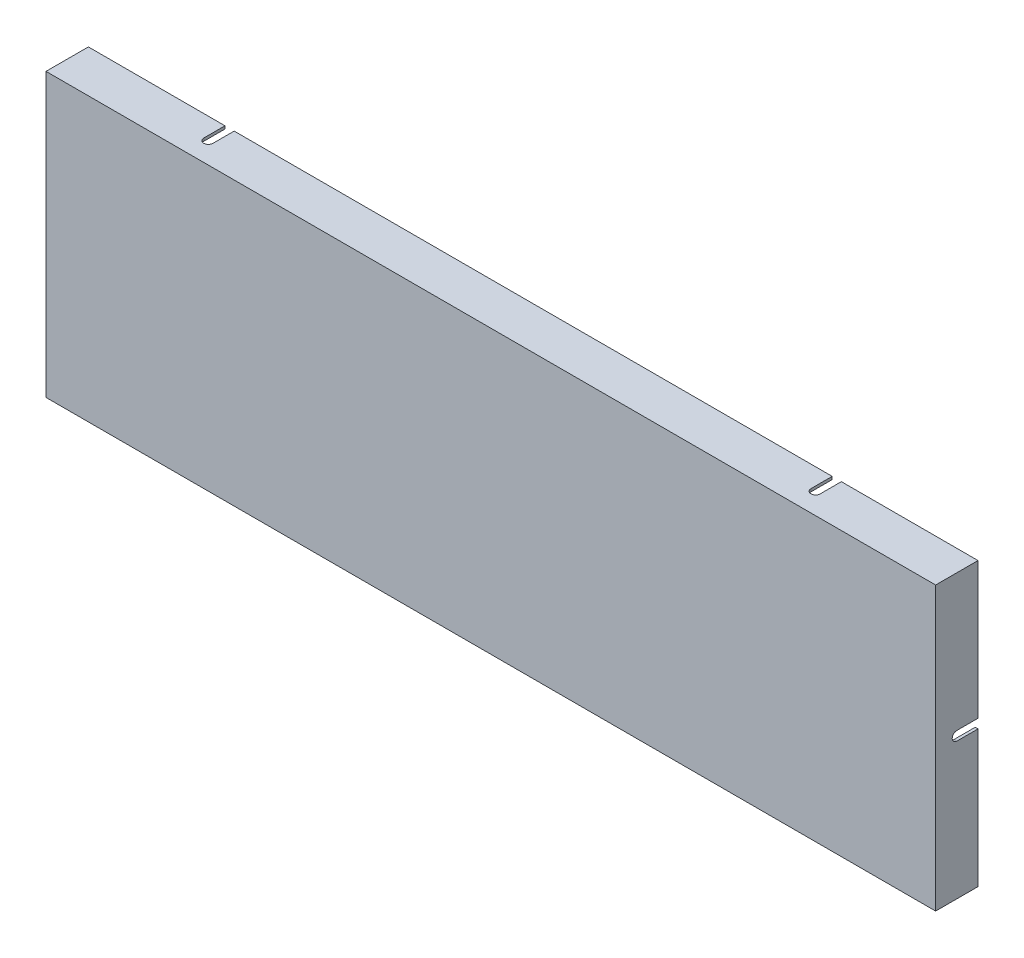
ISO-10303-21;
HEADER;
FILE_DESCRIPTION(('STEP AP214'),'2;1');
FILE_NAME('part.step','',(''),(''),'','','');
FILE_SCHEMA(('AUTOMOTIVE_DESIGN { 1 0 10303 214 1 1 1 1 }'));
ENDSEC;
DATA;
#1=APPLICATION_CONTEXT('core data for automotive mechanical design processes');
#2=APPLICATION_PROTOCOL_DEFINITION('international standard','automotive_design',2000,#1);
#3=PRODUCT_CONTEXT('',#1,'mechanical');
#4=PRODUCT('Part','Part','',(#3));
#5=PRODUCT_RELATED_PRODUCT_CATEGORY('part','',(#4));
#6=PRODUCT_DEFINITION_FORMATION('','',#4);
#7=PRODUCT_DEFINITION_CONTEXT('part definition',#1,'design');
#8=PRODUCT_DEFINITION('design','',#6,#7);
#9=PRODUCT_DEFINITION_SHAPE('','',#8);
#10=(LENGTH_UNIT() NAMED_UNIT(*) SI_UNIT(.MILLI.,.METRE.));
#11=(NAMED_UNIT(*) PLANE_ANGLE_UNIT() SI_UNIT($,.RADIAN.));
#12=(NAMED_UNIT(*) SI_UNIT($,.STERADIAN.) SOLID_ANGLE_UNIT());
#13=UNCERTAINTY_MEASURE_WITH_UNIT(LENGTH_MEASURE(1.E-05),#10,'distance_accuracy_value','');
#14=(GEOMETRIC_REPRESENTATION_CONTEXT(3) GLOBAL_UNCERTAINTY_ASSIGNED_CONTEXT((#13)) GLOBAL_UNIT_ASSIGNED_CONTEXT((#10,
#11,#12)) REPRESENTATION_CONTEXT('',''));
#15=CARTESIAN_POINT('',(0.,0.,0.));
#16=DIRECTION('',(0.,0.,1.));
#17=DIRECTION('',(1.,0.,0.));
#18=AXIS2_PLACEMENT_3D('',#15,#16,#17);
#19=CARTESIAN_POINT('',(0.,-200.,0.));
#20=DIRECTION('',(0.,0.,1.));
#21=DIRECTION('',(1.,0.,0.));
#22=AXIS2_PLACEMENT_3D('',#19,#20,#21);
#23=PLANE('',#22);
#24=DIRECTION('',(0.,1.,0.));
#25=VECTOR('',#24,1.);
#26=CARTESIAN_POINT('',(630.,0.,0.));
#27=LINE('',#26,#25);
#28=CARTESIAN_POINT('',(630.,-96.7499999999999,0.));
#29=VERTEX_POINT('',#28);
#30=CARTESIAN_POINT('',(630.,0.,0.));
#31=VERTEX_POINT('',#30);
#32=EDGE_CURVE('E268',#29,#31,#27,.T.);
#33=ORIENTED_EDGE('',*,*,#32,.F.);
#34=DIRECTION('',(-1.,0.,0.));
#35=VECTOR('',#34,1.);
#36=CARTESIAN_POINT('',(630.,-96.7499999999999,0.));
#37=LINE('',#36,#35);
#38=CARTESIAN_POINT('',(628.,-96.7499999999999,0.));
#39=VERTEX_POINT('',#38);
#40=EDGE_CURVE('E477',#29,#39,#37,.T.);
#41=ORIENTED_EDGE('',*,*,#40,.T.);
#42=DIRECTION('',(0.,1.,0.));
#43=VECTOR('',#42,1.);
#44=CARTESIAN_POINT('',(628.,0.,0.));
#45=LINE('',#44,#43);
#46=CARTESIAN_POINT('',(628.,-2.,0.));
#47=VERTEX_POINT('',#46);
#48=EDGE_CURVE('E324',#39,#47,#45,.T.);
#49=ORIENTED_EDGE('',*,*,#48,.T.);
#50=DIRECTION('',(-1.,0.,0.));
#51=VECTOR('',#50,1.);
#52=CARTESIAN_POINT('',(0.,-2.,0.));
#53=LINE('',#52,#51);
#54=CARTESIAN_POINT('',(533.25,-2.,0.));
#55=VERTEX_POINT('',#54);
#56=EDGE_CURVE('E338',#47,#55,#53,.T.);
#57=ORIENTED_EDGE('',*,*,#56,.T.);
#58=DIRECTION('',(0.,1.,0.));
#59=VECTOR('',#58,1.);
#60=CARTESIAN_POINT('',(533.25,-200.,0.));
#61=LINE('',#60,#59);
#62=CARTESIAN_POINT('',(533.25,0.,0.));
#63=VERTEX_POINT('',#62);
#64=EDGE_CURVE('E452',#55,#63,#61,.T.);
#65=ORIENTED_EDGE('',*,*,#64,.T.);
#66=DIRECTION('',(-1.,0.,0.));
#67=VECTOR('',#66,1.);
#68=CARTESIAN_POINT('',(0.,0.,0.));
#69=LINE('',#68,#67);
#70=EDGE_CURVE('E272',#31,#63,#69,.T.);
#71=ORIENTED_EDGE('',*,*,#70,.F.);
#72=EDGE_LOOP('',(#33,#41,#49,#57,#65,#71));
#73=FACE_BOUND('',#72,.T.);
#74=ADVANCED_FACE('F35',(#73),#23,.F.);
#75=DIRECTION('',(0.,-1.,0.));
#76=VECTOR('',#75,1.);
#77=CARTESIAN_POINT('',(2.,0.,0.));
#78=LINE('',#77,#76);
#79=CARTESIAN_POINT('',(2.,-2.,0.));
#80=VERTEX_POINT('',#79);
#81=CARTESIAN_POINT('',(2.,-96.75,0.));
#82=VERTEX_POINT('',#81);
#83=EDGE_CURVE('E384',#80,#82,#78,.T.);
#84=ORIENTED_EDGE('',*,*,#83,.T.);
#85=CARTESIAN_POINT('',(0.,-96.75,0.));
#86=VERTEX_POINT('',#85);
#87=EDGE_CURVE('E318',#82,#86,#37,.T.);
#88=ORIENTED_EDGE('',*,*,#87,.T.);
#89=DIRECTION('',(0.,-1.,0.));
#90=VECTOR('',#89,1.);
#91=CARTESIAN_POINT('',(0.,0.,0.));
#92=LINE('',#91,#90);
#93=CARTESIAN_POINT('',(0.,0.,0.));
#94=VERTEX_POINT('',#93);
#95=EDGE_CURVE('E347',#94,#86,#92,.T.);
#96=ORIENTED_EDGE('',*,*,#95,.F.);
#97=CARTESIAN_POINT('',(96.75,0.,0.));
#98=VERTEX_POINT('',#97);
#99=EDGE_CURVE('E267',#98,#94,#69,.T.);
#100=ORIENTED_EDGE('',*,*,#99,.F.);
#101=DIRECTION('',(0.,1.,0.));
#102=VECTOR('',#101,1.);
#103=CARTESIAN_POINT('',(96.75,-200.,0.));
#104=LINE('',#103,#102);
#105=CARTESIAN_POINT('',(96.75,-2.,0.));
#106=VERTEX_POINT('',#105);
#107=EDGE_CURVE('E408',#106,#98,#104,.T.);
#108=ORIENTED_EDGE('',*,*,#107,.F.);
#109=EDGE_CURVE('E332',#106,#80,#53,.T.);
#110=ORIENTED_EDGE('',*,*,#109,.T.);
#111=EDGE_LOOP('',(#84,#88,#96,#100,#108,#110));
#112=FACE_BOUND('',#111,.T.);
#113=ADVANCED_FACE('F531',(#112),#23,.F.);
#114=CARTESIAN_POINT('',(628.,-198.,0.));
#115=VERTEX_POINT('',#114);
#116=CARTESIAN_POINT('',(628.,-103.25,0.));
#117=VERTEX_POINT('',#116);
#118=EDGE_CURVE('E259',#115,#117,#45,.T.);
#119=ORIENTED_EDGE('',*,*,#118,.T.);
#120=DIRECTION('',(-1.,0.,0.));
#121=VECTOR('',#120,1.);
#122=CARTESIAN_POINT('',(630.,-103.25,0.));
#123=LINE('',#122,#121);
#124=CARTESIAN_POINT('',(630.,-103.25,0.));
#125=VERTEX_POINT('',#124);
#126=EDGE_CURVE('E58',#125,#117,#123,.T.);
#127=ORIENTED_EDGE('',*,*,#126,.F.);
#128=CARTESIAN_POINT('',(630.,-200.,0.));
#129=VERTEX_POINT('',#128);
#130=EDGE_CURVE('E257',#129,#125,#27,.T.);
#131=ORIENTED_EDGE('',*,*,#130,.F.);
#132=DIRECTION('',(1.,0.,0.));
#133=VECTOR('',#132,1.);
#134=CARTESIAN_POINT('',(0.,-200.,0.));
#135=LINE('',#134,#133);
#136=CARTESIAN_POINT('',(533.25,-200.,0.));
#137=VERTEX_POINT('',#136);
#138=EDGE_CURVE('E349',#137,#129,#135,.T.);
#139=ORIENTED_EDGE('',*,*,#138,.F.);
#140=CARTESIAN_POINT('',(533.25,-198.,0.));
#141=VERTEX_POINT('',#140);
#142=EDGE_CURVE('E440',#137,#141,#61,.T.);
#143=ORIENTED_EDGE('',*,*,#142,.T.);
#144=DIRECTION('',(1.,0.,0.));
#145=VECTOR('',#144,1.);
#146=CARTESIAN_POINT('',(0.,-198.,0.));
#147=LINE('',#146,#145);
#148=EDGE_CURVE('E336',#141,#115,#147,.T.);
#149=ORIENTED_EDGE('',*,*,#148,.T.);
#150=EDGE_LOOP('',(#119,#127,#131,#139,#143,#149));
#151=FACE_BOUND('',#150,.T.);
#152=ADVANCED_FACE('F255',(#151),#23,.F.);
#153=CARTESIAN_POINT('',(526.75,0.,0.));
#154=VERTEX_POINT('',#153);
#155=CARTESIAN_POINT('',(103.25,0.,0.));
#156=VERTEX_POINT('',#155);
#157=EDGE_CURVE('E270',#154,#156,#69,.T.);
#158=ORIENTED_EDGE('',*,*,#157,.F.);
#159=DIRECTION('',(0.,1.,0.));
#160=VECTOR('',#159,1.);
#161=CARTESIAN_POINT('',(526.75,-200.,0.));
#162=LINE('',#161,#160);
#163=CARTESIAN_POINT('',(526.75,-2.,0.));
#164=VERTEX_POINT('',#163);
#165=EDGE_CURVE('E444',#164,#154,#162,.T.);
#166=ORIENTED_EDGE('',*,*,#165,.F.);
#167=CARTESIAN_POINT('',(103.25,-2.,0.));
#168=VERTEX_POINT('',#167);
#169=EDGE_CURVE('E605',#164,#168,#53,.T.);
#170=ORIENTED_EDGE('',*,*,#169,.T.);
#171=DIRECTION('',(0.,1.,0.));
#172=VECTOR('',#171,1.);
#173=CARTESIAN_POINT('',(103.25,-200.,0.));
#174=LINE('',#173,#172);
#175=EDGE_CURVE('E414',#168,#156,#174,.T.);
#176=ORIENTED_EDGE('',*,*,#175,.T.);
#177=EDGE_LOOP('',(#158,#166,#170,#176));
#178=FACE_BOUND('',#177,.T.);
#179=ADVANCED_FACE('F579',(#178),#23,.F.);
#180=CARTESIAN_POINT('',(103.25,-198.,0.));
#181=VERTEX_POINT('',#180);
#182=CARTESIAN_POINT('',(526.75,-198.,0.));
#183=VERTEX_POINT('',#182);
#184=EDGE_CURVE('E334',#181,#183,#147,.T.);
#185=ORIENTED_EDGE('',*,*,#184,.T.);
#186=CARTESIAN_POINT('',(526.75,-200.,0.));
#187=VERTEX_POINT('',#186);
#188=EDGE_CURVE('E441',#187,#183,#162,.T.);
#189=ORIENTED_EDGE('',*,*,#188,.F.);
#190=CARTESIAN_POINT('',(103.25,-200.,0.));
#191=VERTEX_POINT('',#190);
#192=EDGE_CURVE('E354',#191,#187,#135,.T.);
#193=ORIENTED_EDGE('',*,*,#192,.F.);
#194=EDGE_CURVE('E402',#191,#181,#174,.T.);
#195=ORIENTED_EDGE('',*,*,#194,.T.);
#196=EDGE_LOOP('',(#185,#189,#193,#195));
#197=FACE_BOUND('',#196,.T.);
#198=ADVANCED_FACE('F544',(#197),#23,.F.);
#199=CARTESIAN_POINT('',(0.,0.,30.));
#200=DIRECTION('',(1.,0.,0.));
#201=DIRECTION('',(0.,1.,0.));
#202=AXIS2_PLACEMENT_3D('',#199,#200,#201);
#203=PLANE('',#202);
#204=ORIENTED_EDGE('',*,*,#95,.T.);
#205=DIRECTION('',(0.,0.,-1.));
#206=VECTOR('',#205,1.);
#207=CARTESIAN_POINT('',(0.,-96.75,0.));
#208=LINE('',#207,#206);
#209=CARTESIAN_POINT('',(0.,-96.75,15.));
#210=VERTEX_POINT('',#209);
#211=EDGE_CURVE('E250',#210,#86,#208,.T.);
#212=ORIENTED_EDGE('',*,*,#211,.F.);
#213=CARTESIAN_POINT('',(0.,-100.,15.));
#214=DIRECTION('',(-1.,0.,0.));
#215=DIRECTION('',(0.,-1.,0.));
#216=AXIS2_PLACEMENT_3D('',#213,#214,#215);
#217=CIRCLE('',#216,3.25);
#218=CARTESIAN_POINT('',(0.,-103.25,15.));
#219=VERTEX_POINT('',#218);
#220=EDGE_CURVE('E482',#219,#210,#217,.T.);
#221=ORIENTED_EDGE('',*,*,#220,.F.);
#222=DIRECTION('',(0.,0.,1.));
#223=VECTOR('',#222,1.);
#224=CARTESIAN_POINT('',(0.,-103.25,0.));
#225=LINE('',#224,#223);
#226=CARTESIAN_POINT('',(0.,-103.25,0.));
#227=VERTEX_POINT('',#226);
#228=EDGE_CURVE('E485',#227,#219,#225,.T.);
#229=ORIENTED_EDGE('',*,*,#228,.F.);
#230=CARTESIAN_POINT('',(0.,-200.,0.));
#231=VERTEX_POINT('',#230);
#232=EDGE_CURVE('E350',#227,#231,#92,.T.);
#233=ORIENTED_EDGE('',*,*,#232,.T.);
#234=DIRECTION('',(0.,0.,-1.));
#235=VECTOR('',#234,1.);
#236=CARTESIAN_POINT('',(0.,-200.,30.));
#237=LINE('',#236,#235);
#238=CARTESIAN_POINT('',(0.,-200.,30.));
#239=VERTEX_POINT('',#238);
#240=EDGE_CURVE('E287',#239,#231,#237,.T.);
#241=ORIENTED_EDGE('',*,*,#240,.F.);
#242=DIRECTION('',(0.,-1.,0.));
#243=VECTOR('',#242,1.);
#244=CARTESIAN_POINT('',(0.,0.,30.));
#245=LINE('',#244,#243);
#246=CARTESIAN_POINT('',(0.,0.,30.));
#247=VERTEX_POINT('',#246);
#248=EDGE_CURVE('E278',#247,#239,#245,.T.);
#249=ORIENTED_EDGE('',*,*,#248,.F.);
#250=DIRECTION('',(0.,0.,-1.));
#251=VECTOR('',#250,1.);
#252=CARTESIAN_POINT('',(0.,0.,30.));
#253=LINE('',#252,#251);
#254=EDGE_CURVE('E279',#247,#94,#253,.T.);
#255=ORIENTED_EDGE('',*,*,#254,.T.);
#256=EDGE_LOOP('',(#204,#212,#221,#229,#233,#241,#249,#255));
#257=FACE_BOUND('',#256,.T.);
#258=ADVANCED_FACE('F37',(#257),#203,.F.);
#259=CARTESIAN_POINT('',(0.,-200.,30.));
#260=DIRECTION('',(0.,1.,0.));
#261=DIRECTION('',(0.,0.,1.));
#262=AXIS2_PLACEMENT_3D('',#259,#260,#261);
#263=PLANE('',#262);
#264=CARTESIAN_POINT('',(530.,-200.,15.));
#265=DIRECTION('',(0.,1.,0.));
#266=DIRECTION('',(0.,0.,1.));
#267=AXIS2_PLACEMENT_3D('',#264,#265,#266);
#268=CIRCLE('',#267,3.25000000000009);
#269=CARTESIAN_POINT('',(526.75,-200.,15.));
#270=VERTEX_POINT('',#269);
#271=CARTESIAN_POINT('',(533.25,-200.,15.));
#272=VERTEX_POINT('',#271);
#273=EDGE_CURVE('E468',#270,#272,#268,.T.);
#274=ORIENTED_EDGE('',*,*,#273,.T.);
#275=DIRECTION('',(0.,0.,-1.));
#276=VECTOR('',#275,1.);
#277=CARTESIAN_POINT('',(533.25,-200.,0.));
#278=LINE('',#277,#276);
#279=EDGE_CURVE('E465',#272,#137,#278,.T.);
#280=ORIENTED_EDGE('',*,*,#279,.T.);
#281=ORIENTED_EDGE('',*,*,#138,.T.);
#282=DIRECTION('',(0.,0.,-1.));
#283=VECTOR('',#282,1.);
#284=CARTESIAN_POINT('',(630.,-200.,30.));
#285=LINE('',#284,#283);
#286=CARTESIAN_POINT('',(630.,-200.,30.));
#287=VERTEX_POINT('',#286);
#288=EDGE_CURVE('E266',#287,#129,#285,.T.);
#289=ORIENTED_EDGE('',*,*,#288,.F.);
#290=DIRECTION('',(1.,0.,0.));
#291=VECTOR('',#290,1.);
#292=CARTESIAN_POINT('',(0.,-200.,30.));
#293=LINE('',#292,#291);
#294=EDGE_CURVE('E343',#239,#287,#293,.T.);
#295=ORIENTED_EDGE('',*,*,#294,.F.);
#296=ORIENTED_EDGE('',*,*,#240,.T.);
#297=CARTESIAN_POINT('',(96.75,-200.,0.));
#298=VERTEX_POINT('',#297);
#299=EDGE_CURVE('E273',#231,#298,#135,.T.);
#300=ORIENTED_EDGE('',*,*,#299,.T.);
#301=DIRECTION('',(0.,0.,1.));
#302=VECTOR('',#301,1.);
#303=CARTESIAN_POINT('',(96.75,-200.,0.));
#304=LINE('',#303,#302);
#305=CARTESIAN_POINT('',(96.75,-200.,15.));
#306=VERTEX_POINT('',#305);
#307=EDGE_CURVE('E419',#298,#306,#304,.T.);
#308=ORIENTED_EDGE('',*,*,#307,.T.);
#309=CARTESIAN_POINT('',(100.,-200.,15.));
#310=DIRECTION('',(0.,1.,0.));
#311=DIRECTION('',(0.,0.,1.));
#312=AXIS2_PLACEMENT_3D('',#309,#310,#311);
#313=CIRCLE('',#312,3.24999999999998);
#314=CARTESIAN_POINT('',(103.25,-200.,15.));
#315=VERTEX_POINT('',#314);
#316=EDGE_CURVE('E430',#306,#315,#313,.T.);
#317=ORIENTED_EDGE('',*,*,#316,.T.);
#318=DIRECTION('',(0.,0.,-1.));
#319=VECTOR('',#318,1.);
#320=CARTESIAN_POINT('',(103.25,-200.,0.));
#321=LINE('',#320,#319);
#322=EDGE_CURVE('E427',#315,#191,#321,.T.);
#323=ORIENTED_EDGE('',*,*,#322,.T.);
#324=ORIENTED_EDGE('',*,*,#192,.T.);
#325=DIRECTION('',(0.,0.,1.));
#326=VECTOR('',#325,1.);
#327=CARTESIAN_POINT('',(526.75,-200.,0.));
#328=LINE('',#327,#326);
#329=EDGE_CURVE('E457',#187,#270,#328,.T.);
#330=ORIENTED_EDGE('',*,*,#329,.T.);
#331=EDGE_LOOP('',(#274,#280,#281,#289,#295,#296,#300,#308,#317,#323,#324,#330));
#332=FACE_BOUND('',#331,.T.);
#333=ADVANCED_FACE('F502',(#332),#263,.F.);
#334=CARTESIAN_POINT('',(630.,0.,30.));
#335=DIRECTION('',(-1.,0.,0.));
#336=DIRECTION('',(0.,0.,1.));
#337=AXIS2_PLACEMENT_3D('',#334,#335,#336);
#338=PLANE('',#337);
#339=CARTESIAN_POINT('',(630.,-99.9999999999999,15.));
#340=DIRECTION('',(-1.,0.,0.));
#341=DIRECTION('',(0.,-1.,0.));
#342=AXIS2_PLACEMENT_3D('',#339,#340,#341);
#343=CIRCLE('',#342,3.25);
#344=CARTESIAN_POINT('',(630.,-103.25,15.));
#345=VERTEX_POINT('',#344);
#346=CARTESIAN_POINT('',(630.,-96.7499999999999,15.));
#347=VERTEX_POINT('',#346);
#348=EDGE_CURVE('E249',#345,#347,#343,.T.);
#349=ORIENTED_EDGE('',*,*,#348,.T.);
#350=DIRECTION('',(0.,0.,-1.));
#351=VECTOR('',#350,1.);
#352=CARTESIAN_POINT('',(630.,-96.7499999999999,0.));
#353=LINE('',#352,#351);
#354=EDGE_CURVE('E317',#347,#29,#353,.T.);
#355=ORIENTED_EDGE('',*,*,#354,.T.);
#356=ORIENTED_EDGE('',*,*,#32,.T.);
#357=DIRECTION('',(0.,0.,-1.));
#358=VECTOR('',#357,1.);
#359=CARTESIAN_POINT('',(630.,0.,30.));
#360=LINE('',#359,#358);
#361=CARTESIAN_POINT('',(630.,0.,30.));
#362=VERTEX_POINT('',#361);
#363=EDGE_CURVE('E282',#362,#31,#360,.T.);
#364=ORIENTED_EDGE('',*,*,#363,.F.);
#365=DIRECTION('',(0.,1.,0.));
#366=VECTOR('',#365,1.);
#367=CARTESIAN_POINT('',(630.,0.,30.));
#368=LINE('',#367,#366);
#369=EDGE_CURVE('E345',#287,#362,#368,.T.);
#370=ORIENTED_EDGE('',*,*,#369,.F.);
#371=ORIENTED_EDGE('',*,*,#288,.T.);
#372=ORIENTED_EDGE('',*,*,#130,.T.);
#373=DIRECTION('',(0.,0.,1.));
#374=VECTOR('',#373,1.);
#375=CARTESIAN_POINT('',(630.,-103.25,0.));
#376=LINE('',#375,#374);
#377=EDGE_CURVE('E241',#125,#345,#376,.T.);
#378=ORIENTED_EDGE('',*,*,#377,.T.);
#379=EDGE_LOOP('',(#349,#355,#356,#364,#370,#371,#372,#378));
#380=FACE_BOUND('',#379,.T.);
#381=ADVANCED_FACE('F263',(#380),#338,.F.);
#382=CARTESIAN_POINT('',(0.,0.,30.));
#383=DIRECTION('',(0.,-1.,0.));
#384=DIRECTION('',(0.,0.,-1.));
#385=AXIS2_PLACEMENT_3D('',#382,#383,#384);
#386=PLANE('',#385);
#387=ORIENTED_EDGE('',*,*,#70,.T.);
#388=DIRECTION('',(0.,0.,-1.));
#389=VECTOR('',#388,1.);
#390=CARTESIAN_POINT('',(533.25,0.,0.));
#391=LINE('',#390,#389);
#392=CARTESIAN_POINT('',(533.25,0.,15.));
#393=VERTEX_POINT('',#392);
#394=EDGE_CURVE('E455',#393,#63,#391,.T.);
#395=ORIENTED_EDGE('',*,*,#394,.F.);
#396=CARTESIAN_POINT('',(530.,0.,15.));
#397=DIRECTION('',(0.,1.,0.));
#398=DIRECTION('',(0.,0.,1.));
#399=AXIS2_PLACEMENT_3D('',#396,#397,#398);
#400=CIRCLE('',#399,3.25000000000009);
#401=CARTESIAN_POINT('',(526.75,0.,15.));
#402=VERTEX_POINT('',#401);
#403=EDGE_CURVE('E458',#402,#393,#400,.T.);
#404=ORIENTED_EDGE('',*,*,#403,.F.);
#405=DIRECTION('',(0.,0.,1.));
#406=VECTOR('',#405,1.);
#407=CARTESIAN_POINT('',(526.75,0.,0.));
#408=LINE('',#407,#406);
#409=EDGE_CURVE('E461',#154,#402,#408,.T.);
#410=ORIENTED_EDGE('',*,*,#409,.F.);
#411=ORIENTED_EDGE('',*,*,#157,.T.);
#412=DIRECTION('',(0.,0.,-1.));
#413=VECTOR('',#412,1.);
#414=CARTESIAN_POINT('',(103.25,0.,0.));
#415=LINE('',#414,#413);
#416=CARTESIAN_POINT('',(103.25,0.,15.));
#417=VERTEX_POINT('',#416);
#418=EDGE_CURVE('E416',#417,#156,#415,.T.);
#419=ORIENTED_EDGE('',*,*,#418,.F.);
#420=CARTESIAN_POINT('',(100.,0.,15.));
#421=DIRECTION('',(0.,1.,0.));
#422=DIRECTION('',(0.,0.,1.));
#423=AXIS2_PLACEMENT_3D('',#420,#421,#422);
#424=CIRCLE('',#423,3.24999999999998);
#425=CARTESIAN_POINT('',(96.75,0.,15.));
#426=VERTEX_POINT('',#425);
#427=EDGE_CURVE('E420',#426,#417,#424,.T.);
#428=ORIENTED_EDGE('',*,*,#427,.F.);
#429=DIRECTION('',(0.,0.,1.));
#430=VECTOR('',#429,1.);
#431=CARTESIAN_POINT('',(96.75,0.,0.));
#432=LINE('',#431,#430);
#433=EDGE_CURVE('E423',#98,#426,#432,.T.);
#434=ORIENTED_EDGE('',*,*,#433,.F.);
#435=ORIENTED_EDGE('',*,*,#99,.T.);
#436=ORIENTED_EDGE('',*,*,#254,.F.);
#437=DIRECTION('',(-1.,0.,0.));
#438=VECTOR('',#437,1.);
#439=CARTESIAN_POINT('',(0.,0.,30.));
#440=LINE('',#439,#438);
#441=EDGE_CURVE('E283',#362,#247,#440,.T.);
#442=ORIENTED_EDGE('',*,*,#441,.F.);
#443=ORIENTED_EDGE('',*,*,#363,.T.);
#444=EDGE_LOOP('',(#387,#395,#404,#410,#411,#419,#428,#434,#435,#436,#442,#443));
#445=FACE_BOUND('',#444,.T.);
#446=ADVANCED_FACE('F494',(#445),#386,.F.);
#447=CARTESIAN_POINT('',(0.,-200.,30.));
#448=DIRECTION('',(0.,0.,1.));
#449=DIRECTION('',(1.,0.,0.));
#450=AXIS2_PLACEMENT_3D('',#447,#448,#449);
#451=PLANE('',#450);
#452=ORIENTED_EDGE('',*,*,#248,.T.);
#453=ORIENTED_EDGE('',*,*,#294,.T.);
#454=ORIENTED_EDGE('',*,*,#369,.T.);
#455=ORIENTED_EDGE('',*,*,#441,.T.);
#456=EDGE_LOOP('',(#452,#453,#454,#455));
#457=FACE_BOUND('',#456,.T.);
#458=ADVANCED_FACE('F499',(#457),#451,.T.);
#459=ORIENTED_EDGE('',*,*,#232,.F.);
#460=CARTESIAN_POINT('',(2.,-103.25,0.));
#461=VERTEX_POINT('',#460);
#462=EDGE_CURVE('E260',#461,#227,#123,.T.);
#463=ORIENTED_EDGE('',*,*,#462,.F.);
#464=CARTESIAN_POINT('',(2.00000000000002,-198.,0.));
#465=VERTEX_POINT('',#464);
#466=EDGE_CURVE('E386',#461,#465,#78,.T.);
#467=ORIENTED_EDGE('',*,*,#466,.T.);
#468=CARTESIAN_POINT('',(96.75,-198.,0.));
#469=VERTEX_POINT('',#468);
#470=EDGE_CURVE('E330',#465,#469,#147,.T.);
#471=ORIENTED_EDGE('',*,*,#470,.T.);
#472=EDGE_CURVE('E405',#298,#469,#104,.T.);
#473=ORIENTED_EDGE('',*,*,#472,.F.);
#474=ORIENTED_EDGE('',*,*,#299,.F.);
#475=EDGE_LOOP('',(#459,#463,#467,#471,#473,#474));
#476=FACE_BOUND('',#475,.T.);
#477=ADVANCED_FACE('F566',(#476),#23,.F.);
#478=CARTESIAN_POINT('',(2.,0.,30.));
#479=DIRECTION('',(1.,0.,0.));
#480=DIRECTION('',(0.,1.,0.));
#481=AXIS2_PLACEMENT_3D('',#478,#479,#480);
#482=PLANE('',#481);
#483=DIRECTION('',(0.,0.,1.));
#484=VECTOR('',#483,1.);
#485=CARTESIAN_POINT('',(2.00000000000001,-96.75,30.));
#486=LINE('',#485,#484);
#487=CARTESIAN_POINT('',(2.,-96.75,15.));
#488=VERTEX_POINT('',#487);
#489=EDGE_CURVE('E464',#82,#488,#486,.T.);
#490=ORIENTED_EDGE('',*,*,#489,.F.);
#491=ORIENTED_EDGE('',*,*,#83,.F.);
#492=DIRECTION('',(0.,0.,-1.));
#493=VECTOR('',#492,1.);
#494=CARTESIAN_POINT('',(2.,-2.,30.));
#495=LINE('',#494,#493);
#496=CARTESIAN_POINT('',(2.,-2.,28.));
#497=VERTEX_POINT('',#496);
#498=EDGE_CURVE('E376',#497,#80,#495,.T.);
#499=ORIENTED_EDGE('',*,*,#498,.F.);
#500=DIRECTION('',(0.,-1.,0.));
#501=VECTOR('',#500,1.);
#502=CARTESIAN_POINT('',(2.,0.,28.));
#503=LINE('',#502,#501);
#504=CARTESIAN_POINT('',(2.00000000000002,-198.,28.));
#505=VERTEX_POINT('',#504);
#506=EDGE_CURVE('E373',#497,#505,#503,.T.);
#507=ORIENTED_EDGE('',*,*,#506,.T.);
#508=DIRECTION('',(0.,0.,-1.));
#509=VECTOR('',#508,1.);
#510=CARTESIAN_POINT('',(2.00000000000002,-198.,30.));
#511=LINE('',#510,#509);
#512=EDGE_CURVE('E355',#505,#465,#511,.T.);
#513=ORIENTED_EDGE('',*,*,#512,.T.);
#514=ORIENTED_EDGE('',*,*,#466,.F.);
#515=DIRECTION('',(0.,0.,-1.));
#516=VECTOR('',#515,1.);
#517=CARTESIAN_POINT('',(2.00000000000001,-103.25,30.));
#518=LINE('',#517,#516);
#519=CARTESIAN_POINT('',(2.00000000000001,-103.25,15.));
#520=VERTEX_POINT('',#519);
#521=EDGE_CURVE('E476',#520,#461,#518,.T.);
#522=ORIENTED_EDGE('',*,*,#521,.F.);
#523=CARTESIAN_POINT('',(2.,-100.,15.));
#524=DIRECTION('',(1.,0.,0.));
#525=DIRECTION('',(0.,1.,0.));
#526=AXIS2_PLACEMENT_3D('',#523,#524,#525);
#527=CIRCLE('',#526,3.25);
#528=EDGE_CURVE('E474',#488,#520,#527,.T.);
#529=ORIENTED_EDGE('',*,*,#528,.F.);
#530=EDGE_LOOP('',(#490,#491,#499,#507,#513,#514,#522,#529));
#531=FACE_BOUND('',#530,.T.);
#532=ADVANCED_FACE('F522',(#531),#482,.T.);
#533=CARTESIAN_POINT('',(0.,-198.,30.));
#534=DIRECTION('',(0.,1.,0.));
#535=DIRECTION('',(0.,0.,1.));
#536=AXIS2_PLACEMENT_3D('',#533,#534,#535);
#537=PLANE('',#536);
#538=DIRECTION('',(0.,0.,-1.));
#539=VECTOR('',#538,1.);
#540=CARTESIAN_POINT('',(533.25,-198.,30.));
#541=LINE('',#540,#539);
#542=CARTESIAN_POINT('',(533.25,-198.,15.));
#543=VERTEX_POINT('',#542);
#544=EDGE_CURVE('E426',#543,#141,#541,.T.);
#545=ORIENTED_EDGE('',*,*,#544,.F.);
#546=CARTESIAN_POINT('',(530.,-198.,15.));
#547=DIRECTION('',(0.,1.,0.));
#548=DIRECTION('',(0.,0.,1.));
#549=AXIS2_PLACEMENT_3D('',#546,#547,#548);
#550=CIRCLE('',#549,3.25000000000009);
#551=CARTESIAN_POINT('',(526.75,-198.,15.));
#552=VERTEX_POINT('',#551);
#553=EDGE_CURVE('E436',#552,#543,#550,.T.);
#554=ORIENTED_EDGE('',*,*,#553,.F.);
#555=DIRECTION('',(0.,0.,1.));
#556=VECTOR('',#555,1.);
#557=CARTESIAN_POINT('',(526.75,-198.,30.));
#558=LINE('',#557,#556);
#559=EDGE_CURVE('E438',#183,#552,#558,.T.);
#560=ORIENTED_EDGE('',*,*,#559,.F.);
#561=ORIENTED_EDGE('',*,*,#184,.F.);
#562=DIRECTION('',(0.,0.,-1.));
#563=VECTOR('',#562,1.);
#564=CARTESIAN_POINT('',(103.25,-198.,30.));
#565=LINE('',#564,#563);
#566=CARTESIAN_POINT('',(103.25,-198.,15.));
#567=VERTEX_POINT('',#566);
#568=EDGE_CURVE('E371',#567,#181,#565,.T.);
#569=ORIENTED_EDGE('',*,*,#568,.F.);
#570=CARTESIAN_POINT('',(100.,-198.,15.));
#571=DIRECTION('',(0.,1.,0.));
#572=DIRECTION('',(0.,0.,1.));
#573=AXIS2_PLACEMENT_3D('',#570,#571,#572);
#574=CIRCLE('',#573,3.24999999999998);
#575=CARTESIAN_POINT('',(96.75,-198.,15.));
#576=VERTEX_POINT('',#575);
#577=EDGE_CURVE('E393',#576,#567,#574,.T.);
#578=ORIENTED_EDGE('',*,*,#577,.F.);
#579=DIRECTION('',(0.,0.,1.));
#580=VECTOR('',#579,1.);
#581=CARTESIAN_POINT('',(96.75,-198.,30.));
#582=LINE('',#581,#580);
#583=EDGE_CURVE('E398',#469,#576,#582,.T.);
#584=ORIENTED_EDGE('',*,*,#583,.F.);
#585=ORIENTED_EDGE('',*,*,#470,.F.);
#586=ORIENTED_EDGE('',*,*,#512,.F.);
#587=DIRECTION('',(1.,0.,0.));
#588=VECTOR('',#587,1.);
#589=CARTESIAN_POINT('',(0.,-198.,28.));
#590=LINE('',#589,#588);
#591=CARTESIAN_POINT('',(628.,-198.,28.));
#592=VERTEX_POINT('',#591);
#593=EDGE_CURVE('E375',#505,#592,#590,.T.);
#594=ORIENTED_EDGE('',*,*,#593,.T.);
#595=DIRECTION('',(0.,0.,-1.));
#596=VECTOR('',#595,1.);
#597=CARTESIAN_POINT('',(628.,-198.,30.));
#598=LINE('',#597,#596);
#599=EDGE_CURVE('E361',#592,#115,#598,.T.);
#600=ORIENTED_EDGE('',*,*,#599,.T.);
#601=ORIENTED_EDGE('',*,*,#148,.F.);
#602=EDGE_LOOP('',(#545,#554,#560,#561,#569,#578,#584,#585,#586,#594,#600,#601));
#603=FACE_BOUND('',#602,.T.);
#604=ADVANCED_FACE('F508',(#603),#537,.T.);
#605=CARTESIAN_POINT('',(628.,0.,30.));
#606=DIRECTION('',(-1.,0.,0.));
#607=DIRECTION('',(0.,0.,1.));
#608=AXIS2_PLACEMENT_3D('',#605,#606,#607);
#609=PLANE('',#608);
#610=DIRECTION('',(0.,0.,-1.));
#611=VECTOR('',#610,1.);
#612=CARTESIAN_POINT('',(628.,-96.7499999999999,30.));
#613=LINE('',#612,#611);
#614=CARTESIAN_POINT('',(628.,-96.7499999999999,15.));
#615=VERTEX_POINT('',#614);
#616=EDGE_CURVE('E11',#615,#39,#613,.T.);
#617=ORIENTED_EDGE('',*,*,#616,.F.);
#618=CARTESIAN_POINT('',(628.,-99.9999999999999,15.));
#619=DIRECTION('',(-1.,0.,0.));
#620=DIRECTION('',(0.,0.,1.));
#621=AXIS2_PLACEMENT_3D('',#618,#619,#620);
#622=CIRCLE('',#621,3.25);
#623=CARTESIAN_POINT('',(628.,-103.25,15.));
#624=VERTEX_POINT('',#623);
#625=EDGE_CURVE('E43',#624,#615,#622,.T.);
#626=ORIENTED_EDGE('',*,*,#625,.F.);
#627=DIRECTION('',(0.,0.,1.));
#628=VECTOR('',#627,1.);
#629=CARTESIAN_POINT('',(628.,-103.25,30.));
#630=LINE('',#629,#628);
#631=EDGE_CURVE('E304',#117,#624,#630,.T.);
#632=ORIENTED_EDGE('',*,*,#631,.F.);
#633=ORIENTED_EDGE('',*,*,#118,.F.);
#634=ORIENTED_EDGE('',*,*,#599,.F.);
#635=DIRECTION('',(0.,1.,0.));
#636=VECTOR('',#635,1.);
#637=CARTESIAN_POINT('',(628.,0.,28.));
#638=LINE('',#637,#636);
#639=CARTESIAN_POINT('',(628.,-2.,28.));
#640=VERTEX_POINT('',#639);
#641=EDGE_CURVE('E381',#592,#640,#638,.T.);
#642=ORIENTED_EDGE('',*,*,#641,.T.);
#643=DIRECTION('',(0.,0.,-1.));
#644=VECTOR('',#643,1.);
#645=CARTESIAN_POINT('',(628.,-2.,30.));
#646=LINE('',#645,#644);
#647=EDGE_CURVE('E326',#640,#47,#646,.T.);
#648=ORIENTED_EDGE('',*,*,#647,.T.);
#649=ORIENTED_EDGE('',*,*,#48,.F.);
#650=EDGE_LOOP('',(#617,#626,#632,#633,#634,#642,#648,#649));
#651=FACE_BOUND('',#650,.T.);
#652=ADVANCED_FACE('F322',(#651),#609,.T.);
#653=CARTESIAN_POINT('',(0.,-2.,30.));
#654=DIRECTION('',(0.,-1.,0.));
#655=DIRECTION('',(0.,0.,-1.));
#656=AXIS2_PLACEMENT_3D('',#653,#654,#655);
#657=PLANE('',#656);
#658=DIRECTION('',(0.,0.,1.));
#659=VECTOR('',#658,1.);
#660=CARTESIAN_POINT('',(533.25,-2.,30.));
#661=LINE('',#660,#659);
#662=CARTESIAN_POINT('',(533.25,-2.,15.));
#663=VERTEX_POINT('',#662);
#664=EDGE_CURVE('E302',#55,#663,#661,.T.);
#665=ORIENTED_EDGE('',*,*,#664,.F.);
#666=ORIENTED_EDGE('',*,*,#56,.F.);
#667=ORIENTED_EDGE('',*,*,#647,.F.);
#668=DIRECTION('',(-1.,0.,0.));
#669=VECTOR('',#668,1.);
#670=CARTESIAN_POINT('',(0.,-2.,28.));
#671=LINE('',#670,#669);
#672=EDGE_CURVE('E378',#640,#497,#671,.T.);
#673=ORIENTED_EDGE('',*,*,#672,.T.);
#674=ORIENTED_EDGE('',*,*,#498,.T.);
#675=ORIENTED_EDGE('',*,*,#109,.F.);
#676=DIRECTION('',(0.,0.,-1.));
#677=VECTOR('',#676,1.);
#678=CARTESIAN_POINT('',(96.75,-2.,30.));
#679=LINE('',#678,#677);
#680=CARTESIAN_POINT('',(96.75,-2.,15.));
#681=VERTEX_POINT('',#680);
#682=EDGE_CURVE('E290',#681,#106,#679,.T.);
#683=ORIENTED_EDGE('',*,*,#682,.F.);
#684=CARTESIAN_POINT('',(100.,-2.,15.));
#685=DIRECTION('',(0.,-1.,0.));
#686=DIRECTION('',(0.,0.,-1.));
#687=AXIS2_PLACEMENT_3D('',#684,#685,#686);
#688=CIRCLE('',#687,3.24999999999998);
#689=CARTESIAN_POINT('',(103.25,-2.,15.));
#690=VERTEX_POINT('',#689);
#691=EDGE_CURVE('E292',#690,#681,#688,.T.);
#692=ORIENTED_EDGE('',*,*,#691,.F.);
#693=DIRECTION('',(0.,0.,1.));
#694=VECTOR('',#693,1.);
#695=CARTESIAN_POINT('',(103.25,-2.,30.));
#696=LINE('',#695,#694);
#697=EDGE_CURVE('E295',#168,#690,#696,.T.);
#698=ORIENTED_EDGE('',*,*,#697,.F.);
#699=ORIENTED_EDGE('',*,*,#169,.F.);
#700=DIRECTION('',(0.,0.,-1.));
#701=VECTOR('',#700,1.);
#702=CARTESIAN_POINT('',(526.75,-2.,30.));
#703=LINE('',#702,#701);
#704=CARTESIAN_POINT('',(526.75,-2.,15.));
#705=VERTEX_POINT('',#704);
#706=EDGE_CURVE('E297',#705,#164,#703,.T.);
#707=ORIENTED_EDGE('',*,*,#706,.F.);
#708=CARTESIAN_POINT('',(530.,-2.,15.));
#709=DIRECTION('',(0.,-1.,0.));
#710=DIRECTION('',(0.,0.,-1.));
#711=AXIS2_PLACEMENT_3D('',#708,#709,#710);
#712=CIRCLE('',#711,3.25000000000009);
#713=EDGE_CURVE('E299',#663,#705,#712,.T.);
#714=ORIENTED_EDGE('',*,*,#713,.F.);
#715=EDGE_LOOP('',(#665,#666,#667,#673,#674,#675,#683,#692,#698,#699,#707,#714));
#716=FACE_BOUND('',#715,.T.);
#717=ADVANCED_FACE('F519',(#716),#657,.T.);
#718=CARTESIAN_POINT('',(0.,-200.,28.));
#719=DIRECTION('',(0.,0.,1.));
#720=DIRECTION('',(1.,0.,0.));
#721=AXIS2_PLACEMENT_3D('',#718,#719,#720);
#722=PLANE('',#721);
#723=ORIENTED_EDGE('',*,*,#506,.F.);
#724=ORIENTED_EDGE('',*,*,#672,.F.);
#725=ORIENTED_EDGE('',*,*,#641,.F.);
#726=ORIENTED_EDGE('',*,*,#593,.F.);
#727=EDGE_LOOP('',(#723,#724,#725,#726));
#728=FACE_BOUND('',#727,.T.);
#729=ADVANCED_FACE('F515',(#728),#722,.F.);
#730=CARTESIAN_POINT('',(96.75,-200.,0.));
#731=DIRECTION('',(-1.,0.,0.));
#732=DIRECTION('',(0.,0.,1.));
#733=AXIS2_PLACEMENT_3D('',#730,#731,#732);
#734=PLANE('',#733);
#735=ORIENTED_EDGE('',*,*,#682,.T.);
#736=ORIENTED_EDGE('',*,*,#107,.T.);
#737=ORIENTED_EDGE('',*,*,#433,.T.);
#738=DIRECTION('',(0.,1.,0.));
#739=VECTOR('',#738,1.);
#740=CARTESIAN_POINT('',(96.75,-200.,15.));
#741=LINE('',#740,#739);
#742=EDGE_CURVE('E407',#681,#426,#741,.T.);
#743=ORIENTED_EDGE('',*,*,#742,.F.);
#744=EDGE_LOOP('',(#735,#736,#737,#743));
#745=FACE_BOUND('',#744,.T.);
#746=ADVANCED_FACE('F604',(#745),#734,.F.);
#747=CARTESIAN_POINT('',(100.,-200.,15.));
#748=DIRECTION('',(0.,1.,0.));
#749=DIRECTION('',(0.,0.,1.));
#750=AXIS2_PLACEMENT_3D('',#747,#748,#749);
#751=CYLINDRICAL_SURFACE('',#750,3.24999999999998);
#752=ORIENTED_EDGE('',*,*,#691,.T.);
#753=ORIENTED_EDGE('',*,*,#742,.T.);
#754=ORIENTED_EDGE('',*,*,#427,.T.);
#755=DIRECTION('',(0.,1.,0.));
#756=VECTOR('',#755,1.);
#757=CARTESIAN_POINT('',(103.25,-200.,15.));
#758=LINE('',#757,#756);
#759=EDGE_CURVE('E411',#690,#417,#758,.T.);
#760=ORIENTED_EDGE('',*,*,#759,.F.);
#761=EDGE_LOOP('',(#752,#753,#754,#760));
#762=FACE_BOUND('',#761,.T.);
#763=ADVANCED_FACE('F601',(#762),#751,.F.);
#764=CARTESIAN_POINT('',(103.25,-200.,0.));
#765=DIRECTION('',(1.,0.,0.));
#766=DIRECTION('',(0.,0.,-1.));
#767=AXIS2_PLACEMENT_3D('',#764,#765,#766);
#768=PLANE('',#767);
#769=ORIENTED_EDGE('',*,*,#697,.T.);
#770=ORIENTED_EDGE('',*,*,#759,.T.);
#771=ORIENTED_EDGE('',*,*,#418,.T.);
#772=ORIENTED_EDGE('',*,*,#175,.F.);
#773=EDGE_LOOP('',(#769,#770,#771,#772));
#774=FACE_BOUND('',#773,.T.);
#775=ADVANCED_FACE('F596',(#774),#768,.F.);
#776=ORIENTED_EDGE('',*,*,#568,.T.);
#777=ORIENTED_EDGE('',*,*,#194,.F.);
#778=ORIENTED_EDGE('',*,*,#322,.F.);
#779=EDGE_CURVE('E412',#315,#567,#758,.T.);
#780=ORIENTED_EDGE('',*,*,#779,.T.);
#781=EDGE_LOOP('',(#776,#777,#778,#780));
#782=FACE_BOUND('',#781,.T.);
#783=ADVANCED_FACE('F720',(#782),#768,.F.);
#784=ORIENTED_EDGE('',*,*,#577,.T.);
#785=ORIENTED_EDGE('',*,*,#779,.F.);
#786=ORIENTED_EDGE('',*,*,#316,.F.);
#787=EDGE_CURVE('E409',#306,#576,#741,.T.);
#788=ORIENTED_EDGE('',*,*,#787,.T.);
#789=EDGE_LOOP('',(#784,#785,#786,#788));
#790=FACE_BOUND('',#789,.T.);
#791=ADVANCED_FACE('F619',(#790),#751,.F.);
#792=ORIENTED_EDGE('',*,*,#583,.T.);
#793=ORIENTED_EDGE('',*,*,#787,.F.);
#794=ORIENTED_EDGE('',*,*,#307,.F.);
#795=ORIENTED_EDGE('',*,*,#472,.T.);
#796=EDGE_LOOP('',(#792,#793,#794,#795));
#797=FACE_BOUND('',#796,.T.);
#798=ADVANCED_FACE('F613',(#797),#734,.F.);
#799=CARTESIAN_POINT('',(526.75,-200.,0.));
#800=DIRECTION('',(-1.,0.,0.));
#801=DIRECTION('',(0.,0.,1.));
#802=AXIS2_PLACEMENT_3D('',#799,#800,#801);
#803=PLANE('',#802);
#804=ORIENTED_EDGE('',*,*,#706,.T.);
#805=ORIENTED_EDGE('',*,*,#165,.T.);
#806=ORIENTED_EDGE('',*,*,#409,.T.);
#807=DIRECTION('',(0.,1.,0.));
#808=VECTOR('',#807,1.);
#809=CARTESIAN_POINT('',(526.75,-200.,15.));
#810=LINE('',#809,#808);
#811=EDGE_CURVE('E443',#705,#402,#810,.T.);
#812=ORIENTED_EDGE('',*,*,#811,.F.);
#813=EDGE_LOOP('',(#804,#805,#806,#812));
#814=FACE_BOUND('',#813,.T.);
#815=ADVANCED_FACE('F611',(#814),#803,.F.);
#816=CARTESIAN_POINT('',(530.,-200.,15.));
#817=DIRECTION('',(0.,1.,0.));
#818=DIRECTION('',(0.,0.,1.));
#819=AXIS2_PLACEMENT_3D('',#816,#817,#818);
#820=CYLINDRICAL_SURFACE('',#819,3.25000000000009);
#821=ORIENTED_EDGE('',*,*,#713,.T.);
#822=ORIENTED_EDGE('',*,*,#811,.T.);
#823=ORIENTED_EDGE('',*,*,#403,.T.);
#824=DIRECTION('',(0.,1.,0.));
#825=VECTOR('',#824,1.);
#826=CARTESIAN_POINT('',(533.25,-200.,15.));
#827=LINE('',#826,#825);
#828=EDGE_CURVE('E448',#663,#393,#827,.T.);
#829=ORIENTED_EDGE('',*,*,#828,.F.);
#830=EDGE_LOOP('',(#821,#822,#823,#829));
#831=FACE_BOUND('',#830,.T.);
#832=ADVANCED_FACE('F561',(#831),#820,.F.);
#833=CARTESIAN_POINT('',(533.25,-200.,0.));
#834=DIRECTION('',(1.,0.,0.));
#835=DIRECTION('',(0.,0.,-1.));
#836=AXIS2_PLACEMENT_3D('',#833,#834,#835);
#837=PLANE('',#836);
#838=ORIENTED_EDGE('',*,*,#664,.T.);
#839=ORIENTED_EDGE('',*,*,#828,.T.);
#840=ORIENTED_EDGE('',*,*,#394,.T.);
#841=ORIENTED_EDGE('',*,*,#64,.F.);
#842=EDGE_LOOP('',(#838,#839,#840,#841));
#843=FACE_BOUND('',#842,.T.);
#844=ADVANCED_FACE('F554',(#843),#837,.F.);
#845=ORIENTED_EDGE('',*,*,#544,.T.);
#846=ORIENTED_EDGE('',*,*,#142,.F.);
#847=ORIENTED_EDGE('',*,*,#279,.F.);
#848=EDGE_CURVE('E449',#272,#543,#827,.T.);
#849=ORIENTED_EDGE('',*,*,#848,.T.);
#850=EDGE_LOOP('',(#845,#846,#847,#849));
#851=FACE_BOUND('',#850,.T.);
#852=ADVANCED_FACE('F552',(#851),#837,.F.);
#853=ORIENTED_EDGE('',*,*,#553,.T.);
#854=ORIENTED_EDGE('',*,*,#848,.F.);
#855=ORIENTED_EDGE('',*,*,#273,.F.);
#856=EDGE_CURVE('E445',#270,#552,#810,.T.);
#857=ORIENTED_EDGE('',*,*,#856,.T.);
#858=EDGE_LOOP('',(#853,#854,#855,#857));
#859=FACE_BOUND('',#858,.T.);
#860=ADVANCED_FACE('F550',(#859),#820,.F.);
#861=ORIENTED_EDGE('',*,*,#559,.T.);
#862=ORIENTED_EDGE('',*,*,#856,.F.);
#863=ORIENTED_EDGE('',*,*,#329,.F.);
#864=ORIENTED_EDGE('',*,*,#188,.T.);
#865=EDGE_LOOP('',(#861,#862,#863,#864));
#866=FACE_BOUND('',#865,.T.);
#867=ADVANCED_FACE('F548',(#866),#803,.F.);
#868=CARTESIAN_POINT('',(630.,-103.25,0.));
#869=DIRECTION('',(0.,-1.,0.));
#870=DIRECTION('',(1.,0.,0.));
#871=AXIS2_PLACEMENT_3D('',#868,#869,#870);
#872=PLANE('',#871);
#873=ORIENTED_EDGE('',*,*,#631,.T.);
#874=DIRECTION('',(-1.,0.,0.));
#875=VECTOR('',#874,1.);
#876=CARTESIAN_POINT('',(630.,-103.25,15.));
#877=LINE('',#876,#875);
#878=EDGE_CURVE('E244',#345,#624,#877,.T.);
#879=ORIENTED_EDGE('',*,*,#878,.F.);
#880=ORIENTED_EDGE('',*,*,#377,.F.);
#881=ORIENTED_EDGE('',*,*,#126,.T.);
#882=EDGE_LOOP('',(#873,#879,#880,#881));
#883=FACE_BOUND('',#882,.T.);
#884=ADVANCED_FACE('F242',(#883),#872,.F.);
#885=CARTESIAN_POINT('',(630.,-99.9999999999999,15.));
#886=DIRECTION('',(-1.,0.,0.));
#887=DIRECTION('',(0.,-1.,0.));
#888=AXIS2_PLACEMENT_3D('',#885,#886,#887);
#889=CYLINDRICAL_SURFACE('',#888,3.25);
#890=ORIENTED_EDGE('',*,*,#625,.T.);
#891=DIRECTION('',(-1.,0.,0.));
#892=VECTOR('',#891,1.);
#893=CARTESIAN_POINT('',(630.,-96.7499999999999,15.));
#894=LINE('',#893,#892);
#895=EDGE_CURVE('E309',#347,#615,#894,.T.);
#896=ORIENTED_EDGE('',*,*,#895,.F.);
#897=ORIENTED_EDGE('',*,*,#348,.F.);
#898=ORIENTED_EDGE('',*,*,#878,.T.);
#899=EDGE_LOOP('',(#890,#896,#897,#898));
#900=FACE_BOUND('',#899,.T.);
#901=ADVANCED_FACE('F308',(#900),#889,.F.);
#902=CARTESIAN_POINT('',(630.,-96.7499999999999,0.));
#903=DIRECTION('',(0.,1.,0.));
#904=DIRECTION('',(-1.,0.,0.));
#905=AXIS2_PLACEMENT_3D('',#902,#903,#904);
#906=PLANE('',#905);
#907=ORIENTED_EDGE('',*,*,#616,.T.);
#908=ORIENTED_EDGE('',*,*,#40,.F.);
#909=ORIENTED_EDGE('',*,*,#354,.F.);
#910=ORIENTED_EDGE('',*,*,#895,.T.);
#911=EDGE_LOOP('',(#907,#908,#909,#910));
#912=FACE_BOUND('',#911,.T.);
#913=ADVANCED_FACE('F314',(#912),#906,.F.);
#914=ORIENTED_EDGE('',*,*,#489,.T.);
#915=EDGE_CURVE('E319',#488,#210,#894,.T.);
#916=ORIENTED_EDGE('',*,*,#915,.T.);
#917=ORIENTED_EDGE('',*,*,#211,.T.);
#918=ORIENTED_EDGE('',*,*,#87,.F.);
#919=EDGE_LOOP('',(#914,#916,#917,#918));
#920=FACE_BOUND('',#919,.T.);
#921=ADVANCED_FACE('F527',(#920),#906,.F.);
#922=ORIENTED_EDGE('',*,*,#528,.T.);
#923=EDGE_CURVE('E50',#520,#219,#877,.T.);
#924=ORIENTED_EDGE('',*,*,#923,.T.);
#925=ORIENTED_EDGE('',*,*,#220,.T.);
#926=ORIENTED_EDGE('',*,*,#915,.F.);
#927=EDGE_LOOP('',(#922,#924,#925,#926));
#928=FACE_BOUND('',#927,.T.);
#929=ADVANCED_FACE('F529',(#928),#889,.F.);
#930=ORIENTED_EDGE('',*,*,#521,.T.);
#931=ORIENTED_EDGE('',*,*,#462,.T.);
#932=ORIENTED_EDGE('',*,*,#228,.T.);
#933=ORIENTED_EDGE('',*,*,#923,.F.);
#934=EDGE_LOOP('',(#930,#931,#932,#933));
#935=FACE_BOUND('',#934,.T.);
#936=ADVANCED_FACE('F627',(#935),#872,.F.);
#937=CLOSED_SHELL('',(#74,#113,#152,#179,#198,#258,#333,#381,#446,#458,#477,#532,#604,#652,#717,
#729,#746,#763,#775,#783,#791,#798,#815,#832,#844,#852,#860,#867,#884,#901,#913,#921,#929,#936));
#938=MANIFOLD_SOLID_BREP('B2',#937);
#939=ADVANCED_BREP_SHAPE_REPRESENTATION('',(#18,#938),#14);
#940=SHAPE_DEFINITION_REPRESENTATION(#9,#939);
ENDSEC;
END-ISO-10303-21;
